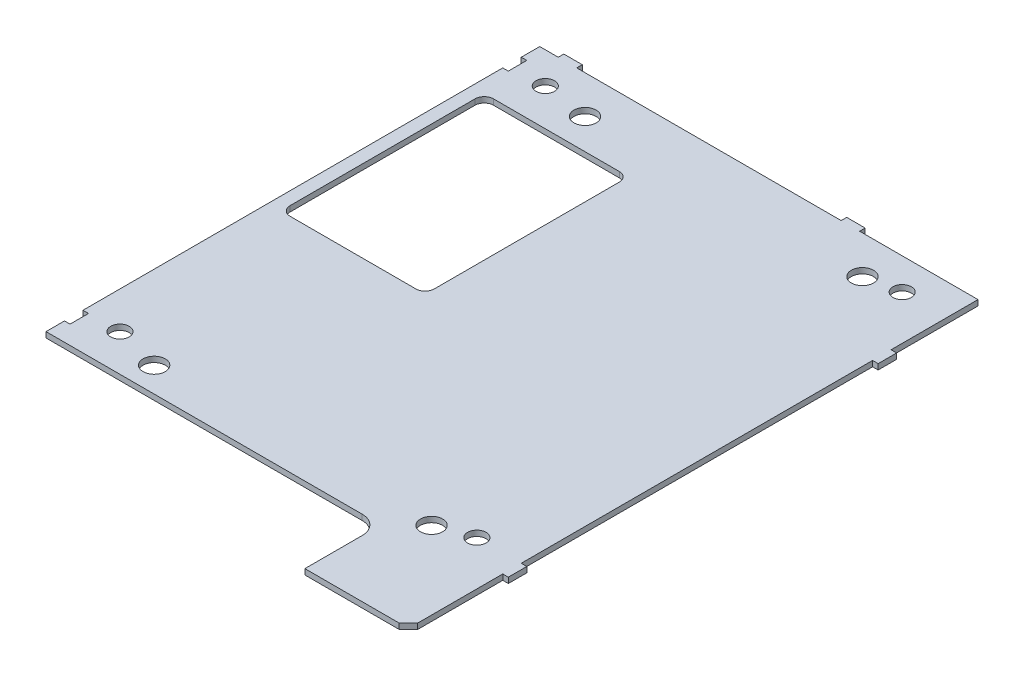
ISO-10303-21;
HEADER;
FILE_DESCRIPTION(('STEP AP214'),'2;1');
FILE_NAME('part.step','',(''),(''),'','','');
FILE_SCHEMA(('AUTOMOTIVE_DESIGN { 1 0 10303 214 1 1 1 1 }'));
ENDSEC;
DATA;
#1=APPLICATION_CONTEXT('core data for automotive mechanical design processes');
#2=APPLICATION_PROTOCOL_DEFINITION('international standard','automotive_design',2000,#1);
#3=PRODUCT_CONTEXT('',#1,'mechanical');
#4=PRODUCT('Part','Part','',(#3));
#5=PRODUCT_RELATED_PRODUCT_CATEGORY('part','',(#4));
#6=PRODUCT_DEFINITION_FORMATION('','',#4);
#7=PRODUCT_DEFINITION_CONTEXT('part definition',#1,'design');
#8=PRODUCT_DEFINITION('design','',#6,#7);
#9=PRODUCT_DEFINITION_SHAPE('','',#8);
#10=(LENGTH_UNIT() NAMED_UNIT(*) SI_UNIT(.MILLI.,.METRE.));
#11=(NAMED_UNIT(*) PLANE_ANGLE_UNIT() SI_UNIT($,.RADIAN.));
#12=(NAMED_UNIT(*) SI_UNIT($,.STERADIAN.) SOLID_ANGLE_UNIT());
#13=UNCERTAINTY_MEASURE_WITH_UNIT(LENGTH_MEASURE(1.E-05),#10,'distance_accuracy_value','');
#14=(GEOMETRIC_REPRESENTATION_CONTEXT(3) GLOBAL_UNCERTAINTY_ASSIGNED_CONTEXT((#13)) GLOBAL_UNIT_ASSIGNED_CONTEXT((#10,
#11,#12)) REPRESENTATION_CONTEXT('',''));
#15=CARTESIAN_POINT('',(0.,0.,0.));
#16=DIRECTION('',(0.,0.,1.));
#17=DIRECTION('',(1.,0.,0.));
#18=AXIS2_PLACEMENT_3D('',#15,#16,#17);
#19=CARTESIAN_POINT('',(254.,3.,8.00000000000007));
#20=DIRECTION('',(-1.,0.,0.));
#21=DIRECTION('',(0.,0.,1.));
#22=AXIS2_PLACEMENT_3D('',#19,#20,#21);
#23=PLANE('',#22);
#24=DIRECTION('',(0.,0.,-1.));
#25=VECTOR('',#24,1.);
#26=CARTESIAN_POINT('',(254.,3.,8.00000000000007));
#27=LINE('',#26,#25);
#28=CARTESIAN_POINT('',(254.,3.,-260.));
#29=VERTEX_POINT('',#28);
#30=CARTESIAN_POINT('',(254.,3.,-307.));
#31=VERTEX_POINT('',#30);
#32=EDGE_CURVE('E476',#29,#31,#27,.T.);
#33=ORIENTED_EDGE('',*,*,#32,.F.);
#34=DIRECTION('',(0.,-1.,0.));
#35=VECTOR('',#34,1.);
#36=CARTESIAN_POINT('',(254.,13.4403065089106,-260.));
#37=LINE('',#36,#35);
#38=CARTESIAN_POINT('',(254.,0.,-260.));
#39=VERTEX_POINT('',#38);
#40=EDGE_CURVE('E765',#29,#39,#37,.T.);
#41=ORIENTED_EDGE('',*,*,#40,.T.);
#42=DIRECTION('',(0.,0.,-1.));
#43=VECTOR('',#42,1.);
#44=CARTESIAN_POINT('',(254.,0.,8.00000000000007));
#45=LINE('',#44,#43);
#46=CARTESIAN_POINT('',(254.,0.,-307.));
#47=VERTEX_POINT('',#46);
#48=EDGE_CURVE('E474',#39,#47,#45,.T.);
#49=ORIENTED_EDGE('',*,*,#48,.T.);
#50=DIRECTION('',(0.,-1.,0.));
#51=VECTOR('',#50,1.);
#52=CARTESIAN_POINT('',(254.,3.,-307.));
#53=LINE('',#52,#51);
#54=EDGE_CURVE('E482',#31,#47,#53,.T.);
#55=ORIENTED_EDGE('',*,*,#54,.F.);
#56=EDGE_LOOP('',(#33,#41,#49,#55));
#57=FACE_BOUND('',#56,.T.);
#58=ADVANCED_FACE('F39',(#57),#23,.F.);
#59=CARTESIAN_POINT('',(254.,3.,-4.00000000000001));
#60=VERTEX_POINT('',#59);
#61=CARTESIAN_POINT('',(254.,3.,-50.));
#62=VERTEX_POINT('',#61);
#63=EDGE_CURVE('E480',#60,#62,#27,.T.);
#64=ORIENTED_EDGE('',*,*,#63,.F.);
#65=DIRECTION('',(0.,-1.,0.));
#66=VECTOR('',#65,1.);
#67=CARTESIAN_POINT('',(254.,0.,-4.00000000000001));
#68=LINE('',#67,#66);
#69=CARTESIAN_POINT('',(254.,0.,-4.00000000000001));
#70=VERTEX_POINT('',#69);
#71=EDGE_CURVE('E391',#60,#70,#68,.T.);
#72=ORIENTED_EDGE('',*,*,#71,.T.);
#73=CARTESIAN_POINT('',(254.,0.,-50.));
#74=VERTEX_POINT('',#73);
#75=EDGE_CURVE('E473',#70,#74,#45,.T.);
#76=ORIENTED_EDGE('',*,*,#75,.T.);
#77=DIRECTION('',(0.,-1.,0.));
#78=VECTOR('',#77,1.);
#79=CARTESIAN_POINT('',(254.,13.4403065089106,-50.));
#80=LINE('',#79,#78);
#81=EDGE_CURVE('E785',#62,#74,#80,.T.);
#82=ORIENTED_EDGE('',*,*,#81,.F.);
#83=EDGE_LOOP('',(#64,#72,#76,#82));
#84=FACE_BOUND('',#83,.T.);
#85=ADVANCED_FACE('F436',(#84),#23,.F.);
#86=CARTESIAN_POINT('',(0.,3.,-307.));
#87=DIRECTION('',(0.,0.,1.));
#88=DIRECTION('',(1.,0.,0.));
#89=AXIS2_PLACEMENT_3D('',#86,#87,#88);
#90=PLANE('',#89);
#91=DIRECTION('',(-1.,0.,0.));
#92=VECTOR('',#91,1.);
#93=CARTESIAN_POINT('',(0.,0.,-307.));
#94=LINE('',#93,#92);
#95=CARTESIAN_POINT('',(190.,0.,-307.));
#96=VERTEX_POINT('',#95);
#97=EDGE_CURVE('E326',#47,#96,#94,.T.);
#98=ORIENTED_EDGE('',*,*,#97,.T.);
#99=DIRECTION('',(0.,-1.,0.));
#100=VECTOR('',#99,1.);
#101=CARTESIAN_POINT('',(190.,13.4403065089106,-307.));
#102=LINE('',#101,#100);
#103=CARTESIAN_POINT('',(190.,3.,-307.));
#104=VERTEX_POINT('',#103);
#105=EDGE_CURVE('E815',#104,#96,#102,.T.);
#106=ORIENTED_EDGE('',*,*,#105,.F.);
#107=DIRECTION('',(-1.,0.,0.));
#108=VECTOR('',#107,1.);
#109=CARTESIAN_POINT('',(0.,3.,-307.));
#110=LINE('',#109,#108);
#111=EDGE_CURVE('E338',#31,#104,#110,.T.);
#112=ORIENTED_EDGE('',*,*,#111,.F.);
#113=ORIENTED_EDGE('',*,*,#54,.T.);
#114=EDGE_LOOP('',(#98,#106,#112,#113));
#115=FACE_BOUND('',#114,.T.);
#116=ADVANCED_FACE('F443',(#115),#90,.F.);
#117=CARTESIAN_POINT('',(180.,3.,-307.));
#118=VERTEX_POINT('',#117);
#119=CARTESIAN_POINT('',(37.0000000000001,3.,-307.));
#120=VERTEX_POINT('',#119);
#121=EDGE_CURVE('E337',#118,#120,#110,.T.);
#122=ORIENTED_EDGE('',*,*,#121,.F.);
#123=DIRECTION('',(0.,-1.,0.));
#124=VECTOR('',#123,1.);
#125=CARTESIAN_POINT('',(180.,13.4403065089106,-307.));
#126=LINE('',#125,#124);
#127=CARTESIAN_POINT('',(180.,0.,-307.));
#128=VERTEX_POINT('',#127);
#129=EDGE_CURVE('E812',#118,#128,#126,.T.);
#130=ORIENTED_EDGE('',*,*,#129,.T.);
#131=CARTESIAN_POINT('',(37.0000000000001,0.,-307.));
#132=VERTEX_POINT('',#131);
#133=EDGE_CURVE('E323',#128,#132,#94,.T.);
#134=ORIENTED_EDGE('',*,*,#133,.T.);
#135=DIRECTION('',(0.,-1.,0.));
#136=VECTOR('',#135,1.);
#137=CARTESIAN_POINT('',(37.0000000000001,13.4403065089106,-307.));
#138=LINE('',#137,#136);
#139=EDGE_CURVE('E831',#120,#132,#138,.T.);
#140=ORIENTED_EDGE('',*,*,#139,.F.);
#141=EDGE_LOOP('',(#122,#130,#134,#140));
#142=FACE_BOUND('',#141,.T.);
#143=ADVANCED_FACE('F839',(#142),#90,.F.);
#144=CARTESIAN_POINT('',(27.0000000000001,0.,-307.));
#145=VERTEX_POINT('',#144);
#146=CARTESIAN_POINT('',(17.0000000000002,0.,-307.));
#147=VERTEX_POINT('',#146);
#148=EDGE_CURVE('E312',#145,#147,#94,.T.);
#149=ORIENTED_EDGE('',*,*,#148,.T.);
#150=DIRECTION('',(0.,1.,0.));
#151=VECTOR('',#150,1.);
#152=CARTESIAN_POINT('',(17.0000000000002,0.,-307.));
#153=LINE('',#152,#151);
#154=CARTESIAN_POINT('',(17.0000000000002,3.,-307.));
#155=VERTEX_POINT('',#154);
#156=EDGE_CURVE('E294',#147,#155,#153,.T.);
#157=ORIENTED_EDGE('',*,*,#156,.T.);
#158=CARTESIAN_POINT('',(27.0000000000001,3.,-307.));
#159=VERTEX_POINT('',#158);
#160=EDGE_CURVE('E332',#159,#155,#110,.T.);
#161=ORIENTED_EDGE('',*,*,#160,.F.);
#162=DIRECTION('',(0.,-1.,0.));
#163=VECTOR('',#162,1.);
#164=CARTESIAN_POINT('',(27.0000000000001,13.4403065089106,-307.));
#165=LINE('',#164,#163);
#166=EDGE_CURVE('E322',#159,#145,#165,.T.);
#167=ORIENTED_EDGE('',*,*,#166,.T.);
#168=EDGE_LOOP('',(#149,#157,#161,#167));
#169=FACE_BOUND('',#168,.T.);
#170=ADVANCED_FACE('F320',(#169),#90,.F.);
#171=CARTESIAN_POINT('',(0.,3.,0.));
#172=DIRECTION('',(0.,1.,0.));
#173=DIRECTION('',(0.,0.,1.));
#174=AXIS2_PLACEMENT_3D('',#171,#172,#173);
#175=PLANE('',#174);
#176=DIRECTION('',(0.,0.,-1.));
#177=VECTOR('',#176,1.);
#178=CARTESIAN_POINT('',(17.0000000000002,3.,-307.));
#179=LINE('',#178,#177);
#180=CARTESIAN_POINT('',(17.0000000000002,3.,-40.));
#181=VERTEX_POINT('',#180);
#182=CARTESIAN_POINT('',(17.0000000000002,3.,-50.));
#183=VERTEX_POINT('',#182);
#184=EDGE_CURVE('E316',#181,#183,#179,.T.);
#185=ORIENTED_EDGE('',*,*,#184,.F.);
#186=DIRECTION('',(-1.,0.,0.));
#187=VECTOR('',#186,1.);
#188=CARTESIAN_POINT('',(254.,3.,-40.));
#189=LINE('',#188,#187);
#190=CARTESIAN_POINT('',(188.,3.,-40.));
#191=VERTEX_POINT('',#190);
#192=EDGE_CURVE('E705',#191,#181,#189,.T.);
#193=ORIENTED_EDGE('',*,*,#192,.F.);
#194=CARTESIAN_POINT('',(188.,3.,-30.));
#195=DIRECTION('',(0.,1.,0.));
#196=DIRECTION('',(0.,0.,1.));
#197=AXIS2_PLACEMENT_3D('',#194,#195,#196);
#198=CIRCLE('',#197,10.);
#199=CARTESIAN_POINT('',(198.,3.,-30.));
#200=VERTEX_POINT('',#199);
#201=EDGE_CURVE('E400',#191,#200,#198,.F.);
#202=ORIENTED_EDGE('',*,*,#201,.T.);
#203=DIRECTION('',(0.,0.,1.));
#204=VECTOR('',#203,1.);
#205=CARTESIAN_POINT('',(198.,3.,-40.));
#206=LINE('',#205,#204);
#207=CARTESIAN_POINT('',(198.,3.,1.00000000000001));
#208=VERTEX_POINT('',#207);
#209=EDGE_CURVE('E727',#200,#208,#206,.T.);
#210=ORIENTED_EDGE('',*,*,#209,.T.);
#211=DIRECTION('',(1.,0.,0.));
#212=VECTOR('',#211,1.);
#213=CARTESIAN_POINT('',(254.,3.,1.));
#214=LINE('',#213,#212);
#215=CARTESIAN_POINT('',(249.,3.,1.));
#216=VERTEX_POINT('',#215);
#217=EDGE_CURVE('E733',#208,#216,#214,.T.);
#218=ORIENTED_EDGE('',*,*,#217,.T.);
#219=DIRECTION('',(0.707106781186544,0.,-0.707106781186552));
#220=VECTOR('',#219,1.);
#221=CARTESIAN_POINT('',(125.000000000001,3.,125.));
#222=LINE('',#221,#220);
#223=EDGE_CURVE('E389',#216,#60,#222,.T.);
#224=ORIENTED_EDGE('',*,*,#223,.T.);
#225=ORIENTED_EDGE('',*,*,#63,.T.);
#226=DIRECTION('',(-1.,0.,0.));
#227=VECTOR('',#226,1.);
#228=CARTESIAN_POINT('',(254.,3.,-50.));
#229=LINE('',#228,#227);
#230=CARTESIAN_POINT('',(257.,3.,-50.));
#231=VERTEX_POINT('',#230);
#232=EDGE_CURVE('E782',#231,#62,#229,.T.);
#233=ORIENTED_EDGE('',*,*,#232,.F.);
#234=DIRECTION('',(0.,0.,1.));
#235=VECTOR('',#234,1.);
#236=CARTESIAN_POINT('',(257.,3.,-50.));
#237=LINE('',#236,#235);
#238=CARTESIAN_POINT('',(257.,3.,-60.));
#239=VERTEX_POINT('',#238);
#240=EDGE_CURVE('E787',#239,#231,#237,.T.);
#241=ORIENTED_EDGE('',*,*,#240,.F.);
#242=DIRECTION('',(1.,0.,0.));
#243=VECTOR('',#242,1.);
#244=CARTESIAN_POINT('',(254.,3.,-60.));
#245=LINE('',#244,#243);
#246=CARTESIAN_POINT('',(254.,3.,-60.));
#247=VERTEX_POINT('',#246);
#248=EDGE_CURVE('E774',#247,#239,#245,.T.);
#249=ORIENTED_EDGE('',*,*,#248,.F.);
#250=CARTESIAN_POINT('',(254.,3.,-250.));
#251=VERTEX_POINT('',#250);
#252=EDGE_CURVE('E852',#247,#251,#27,.T.);
#253=ORIENTED_EDGE('',*,*,#252,.T.);
#254=DIRECTION('',(-1.,0.,0.));
#255=VECTOR('',#254,1.);
#256=CARTESIAN_POINT('',(254.,3.,-250.));
#257=LINE('',#256,#255);
#258=CARTESIAN_POINT('',(257.,3.,-250.));
#259=VERTEX_POINT('',#258);
#260=EDGE_CURVE('E758',#259,#251,#257,.T.);
#261=ORIENTED_EDGE('',*,*,#260,.F.);
#262=DIRECTION('',(0.,0.,1.));
#263=VECTOR('',#262,1.);
#264=CARTESIAN_POINT('',(257.,3.,-250.));
#265=LINE('',#264,#263);
#266=CARTESIAN_POINT('',(257.,3.,-260.));
#267=VERTEX_POINT('',#266);
#268=EDGE_CURVE('E761',#267,#259,#265,.T.);
#269=ORIENTED_EDGE('',*,*,#268,.F.);
#270=DIRECTION('',(1.,0.,0.));
#271=VECTOR('',#270,1.);
#272=CARTESIAN_POINT('',(254.,3.,-260.));
#273=LINE('',#272,#271);
#274=EDGE_CURVE('E748',#29,#267,#273,.T.);
#275=ORIENTED_EDGE('',*,*,#274,.F.);
#276=ORIENTED_EDGE('',*,*,#32,.T.);
#277=ORIENTED_EDGE('',*,*,#111,.T.);
#278=DIRECTION('',(0.,0.,1.));
#279=VECTOR('',#278,1.);
#280=CARTESIAN_POINT('',(190.,3.,-307.));
#281=LINE('',#280,#279);
#282=CARTESIAN_POINT('',(190.,3.,-310.));
#283=VERTEX_POINT('',#282);
#284=EDGE_CURVE('E813',#283,#104,#281,.T.);
#285=ORIENTED_EDGE('',*,*,#284,.F.);
#286=DIRECTION('',(1.,0.,0.));
#287=VECTOR('',#286,1.);
#288=CARTESIAN_POINT('',(180.,3.,-310.));
#289=LINE('',#288,#287);
#290=CARTESIAN_POINT('',(180.,3.,-310.));
#291=VERTEX_POINT('',#290);
#292=EDGE_CURVE('E799',#291,#283,#289,.T.);
#293=ORIENTED_EDGE('',*,*,#292,.F.);
#294=DIRECTION('',(0.,0.,-1.));
#295=VECTOR('',#294,1.);
#296=CARTESIAN_POINT('',(180.,3.,-307.));
#297=LINE('',#296,#295);
#298=EDGE_CURVE('E808',#118,#291,#297,.T.);
#299=ORIENTED_EDGE('',*,*,#298,.F.);
#300=ORIENTED_EDGE('',*,*,#121,.T.);
#301=DIRECTION('',(0.,0.,1.));
#302=VECTOR('',#301,1.);
#303=CARTESIAN_POINT('',(37.0000000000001,3.,-307.));
#304=LINE('',#303,#302);
#305=CARTESIAN_POINT('',(37.0000000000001,3.,-310.));
#306=VERTEX_POINT('',#305);
#307=EDGE_CURVE('E828',#306,#120,#304,.T.);
#308=ORIENTED_EDGE('',*,*,#307,.F.);
#309=DIRECTION('',(1.,0.,0.));
#310=VECTOR('',#309,1.);
#311=CARTESIAN_POINT('',(27.0000000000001,3.,-310.));
#312=LINE('',#311,#310);
#313=CARTESIAN_POINT('',(27.0000000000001,3.,-310.));
#314=VERTEX_POINT('',#313);
#315=EDGE_CURVE('E701',#314,#306,#312,.T.);
#316=ORIENTED_EDGE('',*,*,#315,.F.);
#317=DIRECTION('',(0.,0.,-1.));
#318=VECTOR('',#317,1.);
#319=CARTESIAN_POINT('',(27.0000000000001,3.,-307.));
#320=LINE('',#319,#318);
#321=EDGE_CURVE('E706',#159,#314,#320,.T.);
#322=ORIENTED_EDGE('',*,*,#321,.F.);
#323=ORIENTED_EDGE('',*,*,#160,.T.);
#324=CARTESIAN_POINT('',(17.0000000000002,3.,-297.));
#325=VERTEX_POINT('',#324);
#326=EDGE_CURVE('E297',#325,#155,#179,.T.);
#327=ORIENTED_EDGE('',*,*,#326,.F.);
#328=DIRECTION('',(1.,0.,0.));
#329=VECTOR('',#328,1.);
#330=CARTESIAN_POINT('',(-19.9999999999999,3.,-297.));
#331=LINE('',#330,#329);
#332=CARTESIAN_POINT('',(20.0000000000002,3.,-297.));
#333=VERTEX_POINT('',#332);
#334=EDGE_CURVE('E484',#325,#333,#331,.T.);
#335=ORIENTED_EDGE('',*,*,#334,.T.);
#336=DIRECTION('',(0.,0.,1.));
#337=VECTOR('',#336,1.);
#338=CARTESIAN_POINT('',(20.0000000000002,3.,-287.));
#339=LINE('',#338,#337);
#340=CARTESIAN_POINT('',(20.0000000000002,3.,-287.));
#341=VERTEX_POINT('',#340);
#342=EDGE_CURVE('E486',#333,#341,#339,.T.);
#343=ORIENTED_EDGE('',*,*,#342,.T.);
#344=DIRECTION('',(-1.,0.,0.));
#345=VECTOR('',#344,1.);
#346=CARTESIAN_POINT('',(-19.9999999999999,3.,-287.));
#347=LINE('',#346,#345);
#348=CARTESIAN_POINT('',(17.0000000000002,3.,-287.));
#349=VERTEX_POINT('',#348);
#350=EDGE_CURVE('E490',#341,#349,#347,.T.);
#351=ORIENTED_EDGE('',*,*,#350,.T.);
#352=CARTESIAN_POINT('',(17.0000000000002,3.,-60.));
#353=VERTEX_POINT('',#352);
#354=EDGE_CURVE('E54',#353,#349,#179,.T.);
#355=ORIENTED_EDGE('',*,*,#354,.F.);
#356=DIRECTION('',(1.,0.,0.));
#357=VECTOR('',#356,1.);
#358=CARTESIAN_POINT('',(-19.9999999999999,3.,-60.));
#359=LINE('',#358,#357);
#360=CARTESIAN_POINT('',(20.0000000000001,3.,-60.));
#361=VERTEX_POINT('',#360);
#362=EDGE_CURVE('E505',#353,#361,#359,.T.);
#363=ORIENTED_EDGE('',*,*,#362,.T.);
#364=DIRECTION('',(0.,0.,1.));
#365=VECTOR('',#364,1.);
#366=CARTESIAN_POINT('',(20.0000000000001,3.,-50.));
#367=LINE('',#366,#365);
#368=CARTESIAN_POINT('',(20.0000000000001,3.,-50.));
#369=VERTEX_POINT('',#368);
#370=EDGE_CURVE('E507',#361,#369,#367,.T.);
#371=ORIENTED_EDGE('',*,*,#370,.T.);
#372=DIRECTION('',(-1.,0.,0.));
#373=VECTOR('',#372,1.);
#374=CARTESIAN_POINT('',(-19.9999999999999,3.,-50.));
#375=LINE('',#374,#373);
#376=EDGE_CURVE('E511',#369,#183,#375,.T.);
#377=ORIENTED_EDGE('',*,*,#376,.T.);
#378=EDGE_LOOP('',(#185,#193,#202,#210,#218,#224,#225,#233,#241,#249,#253,#261,#269,#275,#276,
#277,#285,#293,#299,#300,#308,#316,#322,#323,#327,#335,#343,#351,#355,#363,#371,#377));
#379=FACE_BOUND('',#378,.T.);
#380=CARTESIAN_POINT('',(230.,3.,-60.));
#381=DIRECTION('',(0.,-1.,0.));
#382=DIRECTION('',(0.,0.,-1.));
#383=AXIS2_PLACEMENT_3D('',#380,#381,#382);
#384=CIRCLE('',#383,5.00000000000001);
#385=CARTESIAN_POINT('',(230.,3.,-65.));
#386=VERTEX_POINT('',#385);
#387=EDGE_CURVE('E868',#386,#386,#384,.T.);
#388=ORIENTED_EDGE('',*,*,#387,.T.);
#389=EDGE_LOOP('',(#388));
#390=FACE_BOUND('',#389,.T.);
#391=CARTESIAN_POINT('',(37.0000000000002,3.,-60.));
#392=DIRECTION('',(0.,-1.,0.));
#393=DIRECTION('',(0.,0.,-1.));
#394=AXIS2_PLACEMENT_3D('',#391,#392,#393);
#395=CIRCLE('',#394,5.00000000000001);
#396=CARTESIAN_POINT('',(37.0000000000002,3.,-65.));
#397=VERTEX_POINT('',#396);
#398=EDGE_CURVE('E734',#397,#397,#395,.T.);
#399=ORIENTED_EDGE('',*,*,#398,.T.);
#400=EDGE_LOOP('',(#399));
#401=FACE_BOUND('',#400,.T.);
#402=CARTESIAN_POINT('',(62.0000000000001,3.,-53.5));
#403=DIRECTION('',(0.,-1.,0.));
#404=DIRECTION('',(0.,0.,-1.));
#405=AXIS2_PLACEMENT_3D('',#402,#403,#404);
#406=CIRCLE('',#405,5.99999999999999);
#407=CARTESIAN_POINT('',(62.0000000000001,3.,-59.5));
#408=VERTEX_POINT('',#407);
#409=EDGE_CURVE('E528',#408,#408,#406,.T.);
#410=ORIENTED_EDGE('',*,*,#409,.T.);
#411=EDGE_LOOP('',(#410));
#412=FACE_BOUND('',#411,.T.);
#413=CARTESIAN_POINT('',(212.,3.,-53.5));
#414=DIRECTION('',(0.,-1.,0.));
#415=DIRECTION('',(0.,0.,-1.));
#416=AXIS2_PLACEMENT_3D('',#413,#414,#415);
#417=CIRCLE('',#416,6.00000000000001);
#418=CARTESIAN_POINT('',(212.,3.,-59.5));
#419=VERTEX_POINT('',#418);
#420=EDGE_CURVE('E534',#419,#419,#417,.T.);
#421=ORIENTED_EDGE('',*,*,#420,.T.);
#422=EDGE_LOOP('',(#421));
#423=FACE_BOUND('',#422,.T.);
#424=CARTESIAN_POINT('',(212.,3.,-286.5));
#425=DIRECTION('',(0.,-1.,0.));
#426=DIRECTION('',(0.,0.,-1.));
#427=AXIS2_PLACEMENT_3D('',#424,#425,#426);
#428=CIRCLE('',#427,6.00000000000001);
#429=CARTESIAN_POINT('',(212.,3.,-292.5));
#430=VERTEX_POINT('',#429);
#431=EDGE_CURVE('E540',#430,#430,#428,.T.);
#432=ORIENTED_EDGE('',*,*,#431,.T.);
#433=EDGE_LOOP('',(#432));
#434=FACE_BOUND('',#433,.T.);
#435=CARTESIAN_POINT('',(62.0000000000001,3.,-286.5));
#436=DIRECTION('',(0.,-1.,0.));
#437=DIRECTION('',(0.,0.,-1.));
#438=AXIS2_PLACEMENT_3D('',#435,#436,#437);
#439=CIRCLE('',#438,5.99999999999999);
#440=CARTESIAN_POINT('',(62.0000000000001,3.,-292.5));
#441=VERTEX_POINT('',#440);
#442=EDGE_CURVE('E546',#441,#441,#439,.T.);
#443=ORIENTED_EDGE('',*,*,#442,.T.);
#444=EDGE_LOOP('',(#443));
#445=FACE_BOUND('',#444,.T.);
#446=DIRECTION('',(0.,0.,-1.));
#447=VECTOR('',#446,1.);
#448=CARTESIAN_POINT('',(102.,3.,-270.));
#449=LINE('',#448,#447);
#450=CARTESIAN_POINT('',(102.,3.,-165.));
#451=VERTEX_POINT('',#450);
#452=CARTESIAN_POINT('',(102.,3.,-265.));
#453=VERTEX_POINT('',#452);
#454=EDGE_CURVE('E561',#451,#453,#449,.T.);
#455=ORIENTED_EDGE('',*,*,#454,.F.);
#456=CARTESIAN_POINT('',(97.,3.,-165.));
#457=DIRECTION('',(0.,1.,0.));
#458=DIRECTION('',(0.,0.,1.));
#459=AXIS2_PLACEMENT_3D('',#456,#457,#458);
#460=CIRCLE('',#459,5.);
#461=CARTESIAN_POINT('',(97.,3.,-160.));
#462=VERTEX_POINT('',#461);
#463=EDGE_CURVE('E382',#451,#462,#460,.F.);
#464=ORIENTED_EDGE('',*,*,#463,.T.);
#465=DIRECTION('',(-1.,0.,0.));
#466=VECTOR('',#465,1.);
#467=CARTESIAN_POINT('',(24.0000000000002,3.,-160.));
#468=LINE('',#467,#466);
#469=CARTESIAN_POINT('',(29.0000000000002,3.,-160.));
#470=VERTEX_POINT('',#469);
#471=EDGE_CURVE('E549',#462,#470,#468,.T.);
#472=ORIENTED_EDGE('',*,*,#471,.T.);
#473=CARTESIAN_POINT('',(29.0000000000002,3.,-165.));
#474=DIRECTION('',(0.,1.,0.));
#475=DIRECTION('',(0.,0.,1.));
#476=AXIS2_PLACEMENT_3D('',#473,#474,#475);
#477=CIRCLE('',#476,5.);
#478=CARTESIAN_POINT('',(24.0000000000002,3.,-165.));
#479=VERTEX_POINT('',#478);
#480=EDGE_CURVE('E378',#470,#479,#477,.F.);
#481=ORIENTED_EDGE('',*,*,#480,.T.);
#482=DIRECTION('',(0.,0.,1.));
#483=VECTOR('',#482,1.);
#484=CARTESIAN_POINT('',(24.0000000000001,3.,-70.));
#485=LINE('',#484,#483);
#486=CARTESIAN_POINT('',(24.0000000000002,3.,-265.));
#487=VERTEX_POINT('',#486);
#488=EDGE_CURVE('E558',#487,#479,#485,.T.);
#489=ORIENTED_EDGE('',*,*,#488,.F.);
#490=CARTESIAN_POINT('',(29.0000000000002,3.,-265.));
#491=DIRECTION('',(0.,1.,0.));
#492=DIRECTION('',(0.,0.,1.));
#493=AXIS2_PLACEMENT_3D('',#490,#491,#492);
#494=CIRCLE('',#493,5.);
#495=CARTESIAN_POINT('',(29.0000000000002,3.,-270.));
#496=VERTEX_POINT('',#495);
#497=EDGE_CURVE('E366',#487,#496,#494,.F.);
#498=ORIENTED_EDGE('',*,*,#497,.T.);
#499=DIRECTION('',(-1.,0.,0.));
#500=VECTOR('',#499,1.);
#501=CARTESIAN_POINT('',(0.,3.,-270.));
#502=LINE('',#501,#500);
#503=CARTESIAN_POINT('',(97.,3.,-270.));
#504=VERTEX_POINT('',#503);
#505=EDGE_CURVE('E562',#504,#496,#502,.T.);
#506=ORIENTED_EDGE('',*,*,#505,.F.);
#507=CARTESIAN_POINT('',(97.,3.,-265.));
#508=DIRECTION('',(0.,1.,0.));
#509=DIRECTION('',(0.,0.,1.));
#510=AXIS2_PLACEMENT_3D('',#507,#508,#509);
#511=CIRCLE('',#510,5.);
#512=EDGE_CURVE('E352',#504,#453,#511,.F.);
#513=ORIENTED_EDGE('',*,*,#512,.T.);
#514=EDGE_LOOP('',(#455,#464,#472,#481,#489,#498,#506,#513));
#515=FACE_BOUND('',#514,.T.);
#516=CARTESIAN_POINT('',(37.0000000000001,3.,-290.));
#517=DIRECTION('',(0.,-1.,0.));
#518=DIRECTION('',(0.,0.,-1.));
#519=AXIS2_PLACEMENT_3D('',#516,#517,#518);
#520=CIRCLE('',#519,5.00000000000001);
#521=CARTESIAN_POINT('',(37.0000000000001,3.,-295.));
#522=VERTEX_POINT('',#521);
#523=EDGE_CURVE('E404',#522,#522,#520,.T.);
#524=ORIENTED_EDGE('',*,*,#523,.T.);
#525=EDGE_LOOP('',(#524));
#526=FACE_BOUND('',#525,.T.);
#527=CARTESIAN_POINT('',(230.,3.,-290.));
#528=DIRECTION('',(0.,-1.,0.));
#529=DIRECTION('',(0.,0.,-1.));
#530=AXIS2_PLACEMENT_3D('',#527,#528,#529);
#531=CIRCLE('',#530,5.00000000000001);
#532=CARTESIAN_POINT('',(230.,3.,-295.));
#533=VERTEX_POINT('',#532);
#534=EDGE_CURVE('E47',#533,#533,#531,.T.);
#535=ORIENTED_EDGE('',*,*,#534,.T.);
#536=EDGE_LOOP('',(#535));
#537=FACE_BOUND('',#536,.T.);
#538=ADVANCED_FACE('F412',(#379,#390,#401,#412,#423,#434,#445,#515,#526,#537),#175,.T.);
#539=CARTESIAN_POINT('',(0.,0.,0.));
#540=DIRECTION('',(0.,1.,0.));
#541=DIRECTION('',(0.,0.,1.));
#542=AXIS2_PLACEMENT_3D('',#539,#540,#541);
#543=PLANE('',#542);
#544=CARTESIAN_POINT('',(230.,0.,-60.));
#545=DIRECTION('',(0.,-1.,0.));
#546=DIRECTION('',(0.,0.,-1.));
#547=AXIS2_PLACEMENT_3D('',#544,#545,#546);
#548=CIRCLE('',#547,5.00000000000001);
#549=CARTESIAN_POINT('',(230.,0.,-65.));
#550=VERTEX_POINT('',#549);
#551=EDGE_CURVE('E864',#550,#550,#548,.T.);
#552=ORIENTED_EDGE('',*,*,#551,.F.);
#553=EDGE_LOOP('',(#552));
#554=FACE_BOUND('',#553,.T.);
#555=CARTESIAN_POINT('',(37.0000000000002,0.,-60.));
#556=DIRECTION('',(0.,-1.,0.));
#557=DIRECTION('',(0.,0.,-1.));
#558=AXIS2_PLACEMENT_3D('',#555,#556,#557);
#559=CIRCLE('',#558,5.00000000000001);
#560=CARTESIAN_POINT('',(37.0000000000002,0.,-65.));
#561=VERTEX_POINT('',#560);
#562=EDGE_CURVE('E738',#561,#561,#559,.T.);
#563=ORIENTED_EDGE('',*,*,#562,.F.);
#564=EDGE_LOOP('',(#563));
#565=FACE_BOUND('',#564,.T.);
#566=CARTESIAN_POINT('',(62.0000000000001,0.,-53.5));
#567=DIRECTION('',(0.,-1.,0.));
#568=DIRECTION('',(0.,0.,-1.));
#569=AXIS2_PLACEMENT_3D('',#566,#567,#568);
#570=CIRCLE('',#569,5.99999999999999);
#571=CARTESIAN_POINT('',(62.0000000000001,0.,-59.5));
#572=VERTEX_POINT('',#571);
#573=EDGE_CURVE('E523',#572,#572,#570,.T.);
#574=ORIENTED_EDGE('',*,*,#573,.F.);
#575=EDGE_LOOP('',(#574));
#576=FACE_BOUND('',#575,.T.);
#577=CARTESIAN_POINT('',(212.,0.,-53.5));
#578=DIRECTION('',(0.,-1.,0.));
#579=DIRECTION('',(0.,0.,-1.));
#580=AXIS2_PLACEMENT_3D('',#577,#578,#579);
#581=CIRCLE('',#580,5.99999999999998);
#582=CARTESIAN_POINT('',(212.,0.,-59.5));
#583=VERTEX_POINT('',#582);
#584=EDGE_CURVE('E531',#583,#583,#581,.T.);
#585=ORIENTED_EDGE('',*,*,#584,.F.);
#586=EDGE_LOOP('',(#585));
#587=FACE_BOUND('',#586,.T.);
#588=CARTESIAN_POINT('',(212.,0.,-286.5));
#589=DIRECTION('',(0.,-1.,0.));
#590=DIRECTION('',(0.,0.,-1.));
#591=AXIS2_PLACEMENT_3D('',#588,#589,#590);
#592=CIRCLE('',#591,5.99999999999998);
#593=CARTESIAN_POINT('',(212.,0.,-292.5));
#594=VERTEX_POINT('',#593);
#595=EDGE_CURVE('E537',#594,#594,#592,.T.);
#596=ORIENTED_EDGE('',*,*,#595,.F.);
#597=EDGE_LOOP('',(#596));
#598=FACE_BOUND('',#597,.T.);
#599=CARTESIAN_POINT('',(62.0000000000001,0.,-286.5));
#600=DIRECTION('',(0.,-1.,0.));
#601=DIRECTION('',(0.,0.,-1.));
#602=AXIS2_PLACEMENT_3D('',#599,#600,#601);
#603=CIRCLE('',#602,5.99999999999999);
#604=CARTESIAN_POINT('',(62.0000000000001,0.,-292.5));
#605=VERTEX_POINT('',#604);
#606=EDGE_CURVE('E543',#605,#605,#603,.T.);
#607=ORIENTED_EDGE('',*,*,#606,.F.);
#608=EDGE_LOOP('',(#607));
#609=FACE_BOUND('',#608,.T.);
#610=DIRECTION('',(0.,0.,1.));
#611=VECTOR('',#610,1.);
#612=CARTESIAN_POINT('',(24.0000000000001,0.,-70.));
#613=LINE('',#612,#611);
#614=CARTESIAN_POINT('',(24.0000000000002,0.,-265.));
#615=VERTEX_POINT('',#614);
#616=CARTESIAN_POINT('',(24.0000000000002,0.,-165.));
#617=VERTEX_POINT('',#616);
#618=EDGE_CURVE('E553',#615,#617,#613,.T.);
#619=ORIENTED_EDGE('',*,*,#618,.T.);
#620=CARTESIAN_POINT('',(29.0000000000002,0.,-165.));
#621=DIRECTION('',(0.,1.,0.));
#622=DIRECTION('',(0.,0.,1.));
#623=AXIS2_PLACEMENT_3D('',#620,#621,#622);
#624=CIRCLE('',#623,5.);
#625=CARTESIAN_POINT('',(29.0000000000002,0.,-160.));
#626=VERTEX_POINT('',#625);
#627=EDGE_CURVE('E380',#617,#626,#624,.T.);
#628=ORIENTED_EDGE('',*,*,#627,.T.);
#629=DIRECTION('',(1.,0.,0.));
#630=VECTOR('',#629,1.);
#631=CARTESIAN_POINT('',(24.0000000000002,0.,-160.));
#632=LINE('',#631,#630);
#633=CARTESIAN_POINT('',(97.,0.,-160.));
#634=VERTEX_POINT('',#633);
#635=EDGE_CURVE('E550',#626,#634,#632,.T.);
#636=ORIENTED_EDGE('',*,*,#635,.T.);
#637=CARTESIAN_POINT('',(97.,0.,-165.));
#638=DIRECTION('',(0.,1.,0.));
#639=DIRECTION('',(0.,0.,1.));
#640=AXIS2_PLACEMENT_3D('',#637,#638,#639);
#641=CIRCLE('',#640,5.);
#642=CARTESIAN_POINT('',(102.,0.,-165.));
#643=VERTEX_POINT('',#642);
#644=EDGE_CURVE('E384',#634,#643,#641,.T.);
#645=ORIENTED_EDGE('',*,*,#644,.T.);
#646=DIRECTION('',(0.,0.,-1.));
#647=VECTOR('',#646,1.);
#648=CARTESIAN_POINT('',(102.,0.,-270.));
#649=LINE('',#648,#647);
#650=CARTESIAN_POINT('',(102.,0.,-265.));
#651=VERTEX_POINT('',#650);
#652=EDGE_CURVE('E328',#643,#651,#649,.T.);
#653=ORIENTED_EDGE('',*,*,#652,.T.);
#654=CARTESIAN_POINT('',(97.,0.,-265.));
#655=DIRECTION('',(0.,1.,0.));
#656=DIRECTION('',(0.,0.,1.));
#657=AXIS2_PLACEMENT_3D('',#654,#655,#656);
#658=CIRCLE('',#657,5.);
#659=CARTESIAN_POINT('',(97.,0.,-270.));
#660=VERTEX_POINT('',#659);
#661=EDGE_CURVE('E357',#651,#660,#658,.T.);
#662=ORIENTED_EDGE('',*,*,#661,.T.);
#663=DIRECTION('',(-1.,0.,0.));
#664=VECTOR('',#663,1.);
#665=CARTESIAN_POINT('',(0.,0.,-270.));
#666=LINE('',#665,#664);
#667=CARTESIAN_POINT('',(29.0000000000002,0.,-270.));
#668=VERTEX_POINT('',#667);
#669=EDGE_CURVE('E324',#660,#668,#666,.T.);
#670=ORIENTED_EDGE('',*,*,#669,.T.);
#671=CARTESIAN_POINT('',(29.0000000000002,0.,-265.));
#672=DIRECTION('',(0.,1.,0.));
#673=DIRECTION('',(0.,0.,1.));
#674=AXIS2_PLACEMENT_3D('',#671,#672,#673);
#675=CIRCLE('',#674,5.);
#676=EDGE_CURVE('E364',#668,#615,#675,.T.);
#677=ORIENTED_EDGE('',*,*,#676,.T.);
#678=EDGE_LOOP('',(#619,#628,#636,#645,#653,#662,#670,#677));
#679=FACE_BOUND('',#678,.T.);
#680=DIRECTION('',(-1.,0.,0.));
#681=VECTOR('',#680,1.);
#682=CARTESIAN_POINT('',(254.,0.,-40.));
#683=LINE('',#682,#681);
#684=CARTESIAN_POINT('',(188.,0.,-40.));
#685=VERTEX_POINT('',#684);
#686=CARTESIAN_POINT('',(17.0000000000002,0.,-40.));
#687=VERTEX_POINT('',#686);
#688=EDGE_CURVE('E477',#685,#687,#683,.T.);
#689=ORIENTED_EDGE('',*,*,#688,.T.);
#690=DIRECTION('',(0.,0.,-1.));
#691=VECTOR('',#690,1.);
#692=CARTESIAN_POINT('',(17.0000000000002,0.,-307.));
#693=LINE('',#692,#691);
#694=CARTESIAN_POINT('',(17.0000000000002,0.,-50.));
#695=VERTEX_POINT('',#694);
#696=EDGE_CURVE('E318',#687,#695,#693,.T.);
#697=ORIENTED_EDGE('',*,*,#696,.T.);
#698=DIRECTION('',(-1.,0.,0.));
#699=VECTOR('',#698,1.);
#700=CARTESIAN_POINT('',(-19.9999999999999,0.,-50.));
#701=LINE('',#700,#699);
#702=CARTESIAN_POINT('',(20.0000000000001,0.,-50.));
#703=VERTEX_POINT('',#702);
#704=EDGE_CURVE('E508',#703,#695,#701,.T.);
#705=ORIENTED_EDGE('',*,*,#704,.F.);
#706=DIRECTION('',(0.,0.,1.));
#707=VECTOR('',#706,1.);
#708=CARTESIAN_POINT('',(20.0000000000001,0.,-50.));
#709=LINE('',#708,#707);
#710=CARTESIAN_POINT('',(20.0000000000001,0.,-60.));
#711=VERTEX_POINT('',#710);
#712=EDGE_CURVE('E516',#711,#703,#709,.T.);
#713=ORIENTED_EDGE('',*,*,#712,.F.);
#714=DIRECTION('',(1.,0.,0.));
#715=VECTOR('',#714,1.);
#716=CARTESIAN_POINT('',(-19.9999999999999,0.,-60.));
#717=LINE('',#716,#715);
#718=CARTESIAN_POINT('',(17.0000000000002,0.,-60.));
#719=VERTEX_POINT('',#718);
#720=EDGE_CURVE('E502',#719,#711,#717,.T.);
#721=ORIENTED_EDGE('',*,*,#720,.F.);
#722=CARTESIAN_POINT('',(17.0000000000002,0.,-287.));
#723=VERTEX_POINT('',#722);
#724=EDGE_CURVE('E315',#719,#723,#693,.T.);
#725=ORIENTED_EDGE('',*,*,#724,.T.);
#726=DIRECTION('',(-1.,0.,0.));
#727=VECTOR('',#726,1.);
#728=CARTESIAN_POINT('',(-19.9999999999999,0.,-287.));
#729=LINE('',#728,#727);
#730=CARTESIAN_POINT('',(20.0000000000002,0.,-287.));
#731=VERTEX_POINT('',#730);
#732=EDGE_CURVE('E487',#731,#723,#729,.T.);
#733=ORIENTED_EDGE('',*,*,#732,.F.);
#734=DIRECTION('',(0.,0.,1.));
#735=VECTOR('',#734,1.);
#736=CARTESIAN_POINT('',(20.0000000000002,0.,-287.));
#737=LINE('',#736,#735);
#738=CARTESIAN_POINT('',(20.0000000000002,0.,-297.));
#739=VERTEX_POINT('',#738);
#740=EDGE_CURVE('E495',#739,#731,#737,.T.);
#741=ORIENTED_EDGE('',*,*,#740,.F.);
#742=DIRECTION('',(1.,0.,0.));
#743=VECTOR('',#742,1.);
#744=CARTESIAN_POINT('',(-19.9999999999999,0.,-297.));
#745=LINE('',#744,#743);
#746=CARTESIAN_POINT('',(17.0000000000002,0.,-297.));
#747=VERTEX_POINT('',#746);
#748=EDGE_CURVE('E314',#747,#739,#745,.T.);
#749=ORIENTED_EDGE('',*,*,#748,.F.);
#750=EDGE_CURVE('E62',#747,#147,#693,.T.);
#751=ORIENTED_EDGE('',*,*,#750,.T.);
#752=ORIENTED_EDGE('',*,*,#148,.F.);
#753=DIRECTION('',(0.,0.,-1.));
#754=VECTOR('',#753,1.);
#755=CARTESIAN_POINT('',(27.0000000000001,0.,-307.));
#756=LINE('',#755,#754);
#757=CARTESIAN_POINT('',(27.0000000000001,0.,-310.));
#758=VERTEX_POINT('',#757);
#759=EDGE_CURVE('E821',#145,#758,#756,.T.);
#760=ORIENTED_EDGE('',*,*,#759,.T.);
#761=DIRECTION('',(1.,0.,0.));
#762=VECTOR('',#761,1.);
#763=CARTESIAN_POINT('',(27.0000000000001,0.,-310.));
#764=LINE('',#763,#762);
#765=CARTESIAN_POINT('',(37.0000000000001,0.,-310.));
#766=VERTEX_POINT('',#765);
#767=EDGE_CURVE('E703',#758,#766,#764,.T.);
#768=ORIENTED_EDGE('',*,*,#767,.T.);
#769=DIRECTION('',(0.,0.,1.));
#770=VECTOR('',#769,1.);
#771=CARTESIAN_POINT('',(37.0000000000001,0.,-307.));
#772=LINE('',#771,#770);
#773=EDGE_CURVE('E822',#766,#132,#772,.T.);
#774=ORIENTED_EDGE('',*,*,#773,.T.);
#775=ORIENTED_EDGE('',*,*,#133,.F.);
#776=DIRECTION('',(0.,0.,-1.));
#777=VECTOR('',#776,1.);
#778=CARTESIAN_POINT('',(180.,0.,-307.));
#779=LINE('',#778,#777);
#780=CARTESIAN_POINT('',(180.,0.,-310.));
#781=VERTEX_POINT('',#780);
#782=EDGE_CURVE('E795',#128,#781,#779,.T.);
#783=ORIENTED_EDGE('',*,*,#782,.T.);
#784=DIRECTION('',(1.,0.,0.));
#785=VECTOR('',#784,1.);
#786=CARTESIAN_POINT('',(180.,0.,-310.));
#787=LINE('',#786,#785);
#788=CARTESIAN_POINT('',(190.,0.,-310.));
#789=VERTEX_POINT('',#788);
#790=EDGE_CURVE('E800',#781,#789,#787,.T.);
#791=ORIENTED_EDGE('',*,*,#790,.T.);
#792=DIRECTION('',(0.,0.,1.));
#793=VECTOR('',#792,1.);
#794=CARTESIAN_POINT('',(190.,0.,-307.));
#795=LINE('',#794,#793);
#796=EDGE_CURVE('E796',#789,#96,#795,.T.);
#797=ORIENTED_EDGE('',*,*,#796,.T.);
#798=ORIENTED_EDGE('',*,*,#97,.F.);
#799=ORIENTED_EDGE('',*,*,#48,.F.);
#800=DIRECTION('',(1.,0.,0.));
#801=VECTOR('',#800,1.);
#802=CARTESIAN_POINT('',(254.,0.,-260.));
#803=LINE('',#802,#801);
#804=CARTESIAN_POINT('',(257.,0.,-260.));
#805=VERTEX_POINT('',#804);
#806=EDGE_CURVE('E752',#39,#805,#803,.T.);
#807=ORIENTED_EDGE('',*,*,#806,.T.);
#808=DIRECTION('',(0.,0.,1.));
#809=VECTOR('',#808,1.);
#810=CARTESIAN_POINT('',(257.,0.,-250.));
#811=LINE('',#810,#809);
#812=CARTESIAN_POINT('',(257.,0.,-250.));
#813=VERTEX_POINT('',#812);
#814=EDGE_CURVE('E749',#805,#813,#811,.T.);
#815=ORIENTED_EDGE('',*,*,#814,.T.);
#816=DIRECTION('',(-1.,0.,0.));
#817=VECTOR('',#816,1.);
#818=CARTESIAN_POINT('',(254.,0.,-250.));
#819=LINE('',#818,#817);
#820=CARTESIAN_POINT('',(254.,0.,-250.));
#821=VERTEX_POINT('',#820);
#822=EDGE_CURVE('E746',#813,#821,#819,.T.);
#823=ORIENTED_EDGE('',*,*,#822,.T.);
#824=CARTESIAN_POINT('',(254.,0.,-60.));
#825=VERTEX_POINT('',#824);
#826=EDGE_CURVE('E465',#825,#821,#45,.T.);
#827=ORIENTED_EDGE('',*,*,#826,.F.);
#828=DIRECTION('',(1.,0.,0.));
#829=VECTOR('',#828,1.);
#830=CARTESIAN_POINT('',(254.,0.,-60.));
#831=LINE('',#830,#829);
#832=CARTESIAN_POINT('',(257.,0.,-60.));
#833=VERTEX_POINT('',#832);
#834=EDGE_CURVE('E770',#825,#833,#831,.T.);
#835=ORIENTED_EDGE('',*,*,#834,.T.);
#836=DIRECTION('',(0.,0.,1.));
#837=VECTOR('',#836,1.);
#838=CARTESIAN_POINT('',(257.,0.,-50.));
#839=LINE('',#838,#837);
#840=CARTESIAN_POINT('',(257.,0.,-50.));
#841=VERTEX_POINT('',#840);
#842=EDGE_CURVE('E775',#833,#841,#839,.T.);
#843=ORIENTED_EDGE('',*,*,#842,.T.);
#844=DIRECTION('',(-1.,0.,0.));
#845=VECTOR('',#844,1.);
#846=CARTESIAN_POINT('',(254.,0.,-50.));
#847=LINE('',#846,#845);
#848=EDGE_CURVE('E771',#841,#74,#847,.T.);
#849=ORIENTED_EDGE('',*,*,#848,.T.);
#850=ORIENTED_EDGE('',*,*,#75,.F.);
#851=DIRECTION('',(-0.707106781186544,0.,0.707106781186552));
#852=VECTOR('',#851,1.);
#853=CARTESIAN_POINT('',(249.,0.,1.));
#854=LINE('',#853,#852);
#855=CARTESIAN_POINT('',(249.,0.,1.));
#856=VERTEX_POINT('',#855);
#857=EDGE_CURVE('E393',#70,#856,#854,.T.);
#858=ORIENTED_EDGE('',*,*,#857,.T.);
#859=DIRECTION('',(-1.,0.,0.));
#860=VECTOR('',#859,1.);
#861=CARTESIAN_POINT('',(254.,0.,1.));
#862=LINE('',#861,#860);
#863=CARTESIAN_POINT('',(198.,0.,1.00000000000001));
#864=VERTEX_POINT('',#863);
#865=EDGE_CURVE('E741',#856,#864,#862,.T.);
#866=ORIENTED_EDGE('',*,*,#865,.T.);
#867=DIRECTION('',(0.,0.,-1.));
#868=VECTOR('',#867,1.);
#869=CARTESIAN_POINT('',(198.,0.,-40.));
#870=LINE('',#869,#868);
#871=CARTESIAN_POINT('',(198.,0.,-30.));
#872=VERTEX_POINT('',#871);
#873=EDGE_CURVE('E745',#864,#872,#870,.T.);
#874=ORIENTED_EDGE('',*,*,#873,.T.);
#875=CARTESIAN_POINT('',(188.,0.,-30.));
#876=DIRECTION('',(0.,1.,0.));
#877=DIRECTION('',(0.,0.,1.));
#878=AXIS2_PLACEMENT_3D('',#875,#876,#877);
#879=CIRCLE('',#878,10.);
#880=EDGE_CURVE('E402',#872,#685,#879,.T.);
#881=ORIENTED_EDGE('',*,*,#880,.T.);
#882=EDGE_LOOP('',(#689,#697,#705,#713,#721,#725,#733,#741,#749,#751,#752,#760,#768,#774,#775,
#783,#791,#797,#798,#799,#807,#815,#823,#827,#835,#843,#849,#850,#858,#866,#874,#881));
#883=FACE_BOUND('',#882,.T.);
#884=CARTESIAN_POINT('',(37.0000000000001,0.,-290.));
#885=DIRECTION('',(0.,-1.,0.));
#886=DIRECTION('',(0.,0.,-1.));
#887=AXIS2_PLACEMENT_3D('',#884,#885,#886);
#888=CIRCLE('',#887,5.00000000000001);
#889=CARTESIAN_POINT('',(37.0000000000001,0.,-295.));
#890=VERTEX_POINT('',#889);
#891=EDGE_CURVE('E407',#890,#890,#888,.T.);
#892=ORIENTED_EDGE('',*,*,#891,.F.);
#893=EDGE_LOOP('',(#892));
#894=FACE_BOUND('',#893,.T.);
#895=CARTESIAN_POINT('',(230.,0.,-290.));
#896=DIRECTION('',(0.,-1.,0.));
#897=DIRECTION('',(0.,0.,-1.));
#898=AXIS2_PLACEMENT_3D('',#895,#896,#897);
#899=CIRCLE('',#898,5.00000000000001);
#900=CARTESIAN_POINT('',(230.,0.,-295.));
#901=VERTEX_POINT('',#900);
#902=EDGE_CURVE('E11',#901,#901,#899,.T.);
#903=ORIENTED_EDGE('',*,*,#902,.F.);
#904=EDGE_LOOP('',(#903));
#905=FACE_BOUND('',#904,.T.);
#906=ADVANCED_FACE('F309',(#554,#565,#576,#587,#598,#609,#679,#883,#894,#905),#543,.F.);
#907=CARTESIAN_POINT('',(0.,0.,-270.));
#908=DIRECTION('',(0.,0.,-1.));
#909=DIRECTION('',(-1.,0.,0.));
#910=AXIS2_PLACEMENT_3D('',#907,#908,#909);
#911=PLANE('',#910);
#912=ORIENTED_EDGE('',*,*,#505,.T.);
#913=DIRECTION('',(0.,-1.,0.));
#914=VECTOR('',#913,1.);
#915=CARTESIAN_POINT('',(29.0000000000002,0.,-270.));
#916=LINE('',#915,#914);
#917=EDGE_CURVE('E359',#496,#668,#916,.T.);
#918=ORIENTED_EDGE('',*,*,#917,.T.);
#919=ORIENTED_EDGE('',*,*,#669,.F.);
#920=DIRECTION('',(0.,1.,0.));
#921=VECTOR('',#920,1.);
#922=CARTESIAN_POINT('',(97.,3.,-270.));
#923=LINE('',#922,#921);
#924=EDGE_CURVE('E346',#660,#504,#923,.T.);
#925=ORIENTED_EDGE('',*,*,#924,.T.);
#926=EDGE_LOOP('',(#912,#918,#919,#925));
#927=FACE_BOUND('',#926,.T.);
#928=ADVANCED_FACE('F421',(#927),#911,.F.);
#929=CARTESIAN_POINT('',(102.,0.,-270.));
#930=DIRECTION('',(1.,0.,0.));
#931=DIRECTION('',(0.,0.,-1.));
#932=AXIS2_PLACEMENT_3D('',#929,#930,#931);
#933=PLANE('',#932);
#934=ORIENTED_EDGE('',*,*,#652,.F.);
#935=DIRECTION('',(0.,1.,0.));
#936=VECTOR('',#935,1.);
#937=CARTESIAN_POINT('',(102.,0.,-165.));
#938=LINE('',#937,#936);
#939=EDGE_CURVE('E375',#643,#451,#938,.T.);
#940=ORIENTED_EDGE('',*,*,#939,.T.);
#941=ORIENTED_EDGE('',*,*,#454,.T.);
#942=DIRECTION('',(0.,1.,0.));
#943=VECTOR('',#942,1.);
#944=CARTESIAN_POINT('',(102.,0.,-265.));
#945=LINE('',#944,#943);
#946=EDGE_CURVE('E342',#453,#651,#945,.F.);
#947=ORIENTED_EDGE('',*,*,#946,.T.);
#948=EDGE_LOOP('',(#934,#940,#941,#947));
#949=FACE_BOUND('',#948,.T.);
#950=ADVANCED_FACE('F428',(#949),#933,.F.);
#951=CARTESIAN_POINT('',(97.,0.,-265.));
#952=DIRECTION('',(0.,-1.,0.));
#953=DIRECTION('',(0.,0.,-1.));
#954=AXIS2_PLACEMENT_3D('',#951,#952,#953);
#955=CYLINDRICAL_SURFACE('',#954,5.);
#956=ORIENTED_EDGE('',*,*,#661,.F.);
#957=ORIENTED_EDGE('',*,*,#946,.F.);
#958=ORIENTED_EDGE('',*,*,#512,.F.);
#959=ORIENTED_EDGE('',*,*,#924,.F.);
#960=EDGE_LOOP('',(#956,#957,#958,#959));
#961=FACE_BOUND('',#960,.T.);
#962=ADVANCED_FACE('F596',(#961),#955,.F.);
#963=CARTESIAN_POINT('',(24.0000000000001,207.782811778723,-70.));
#964=DIRECTION('',(1.,0.,0.));
#965=DIRECTION('',(0.,0.,-1.));
#966=AXIS2_PLACEMENT_3D('',#963,#964,#965);
#967=PLANE('',#966);
#968=ORIENTED_EDGE('',*,*,#488,.T.);
#969=DIRECTION('',(0.,1.,0.));
#970=VECTOR('',#969,1.);
#971=CARTESIAN_POINT('',(24.0000000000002,0.,-165.));
#972=LINE('',#971,#970);
#973=EDGE_CURVE('E373',#479,#617,#972,.F.);
#974=ORIENTED_EDGE('',*,*,#973,.T.);
#975=ORIENTED_EDGE('',*,*,#618,.F.);
#976=DIRECTION('',(0.,-1.,0.));
#977=VECTOR('',#976,1.);
#978=CARTESIAN_POINT('',(24.0000000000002,207.782811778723,-265.));
#979=LINE('',#978,#977);
#980=EDGE_CURVE('E362',#615,#487,#979,.F.);
#981=ORIENTED_EDGE('',*,*,#980,.T.);
#982=EDGE_LOOP('',(#968,#974,#975,#981));
#983=FACE_BOUND('',#982,.T.);
#984=ADVANCED_FACE('F578',(#983),#967,.T.);
#985=CARTESIAN_POINT('',(29.0000000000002,0.,-265.));
#986=DIRECTION('',(0.,-1.,0.));
#987=DIRECTION('',(0.,0.,-1.));
#988=AXIS2_PLACEMENT_3D('',#985,#986,#987);
#989=CYLINDRICAL_SURFACE('',#988,5.);
#990=ORIENTED_EDGE('',*,*,#497,.F.);
#991=ORIENTED_EDGE('',*,*,#980,.F.);
#992=ORIENTED_EDGE('',*,*,#676,.F.);
#993=ORIENTED_EDGE('',*,*,#917,.F.);
#994=EDGE_LOOP('',(#990,#991,#992,#993));
#995=FACE_BOUND('',#994,.T.);
#996=ADVANCED_FACE('F572',(#995),#989,.F.);
#997=CARTESIAN_POINT('',(24.0000000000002,-119.096599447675,-160.));
#998=DIRECTION('',(0.,0.,-1.));
#999=DIRECTION('',(-1.,0.,0.));
#1000=AXIS2_PLACEMENT_3D('',#997,#998,#999);
#1001=PLANE('',#1000);
#1002=ORIENTED_EDGE('',*,*,#635,.F.);
#1003=DIRECTION('',(0.,1.,0.));
#1004=VECTOR('',#1003,1.);
#1005=CARTESIAN_POINT('',(29.0000000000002,3.,-160.));
#1006=LINE('',#1005,#1004);
#1007=EDGE_CURVE('E370',#626,#470,#1006,.T.);
#1008=ORIENTED_EDGE('',*,*,#1007,.T.);
#1009=ORIENTED_EDGE('',*,*,#471,.F.);
#1010=DIRECTION('',(0.,1.,0.));
#1011=VECTOR('',#1010,1.);
#1012=CARTESIAN_POINT('',(97.,-119.096599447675,-160.));
#1013=LINE('',#1012,#1011);
#1014=EDGE_CURVE('E368',#462,#634,#1013,.F.);
#1015=ORIENTED_EDGE('',*,*,#1014,.T.);
#1016=EDGE_LOOP('',(#1002,#1008,#1009,#1015));
#1017=FACE_BOUND('',#1016,.T.);
#1018=ADVANCED_FACE('F587',(#1017),#1001,.T.);
#1019=CARTESIAN_POINT('',(29.0000000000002,-119.096599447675,-165.));
#1020=DIRECTION('',(0.,-1.,0.));
#1021=DIRECTION('',(0.,0.,-1.));
#1022=AXIS2_PLACEMENT_3D('',#1019,#1020,#1021);
#1023=CYLINDRICAL_SURFACE('',#1022,5.);
#1024=ORIENTED_EDGE('',*,*,#627,.F.);
#1025=ORIENTED_EDGE('',*,*,#973,.F.);
#1026=ORIENTED_EDGE('',*,*,#480,.F.);
#1027=ORIENTED_EDGE('',*,*,#1007,.F.);
#1028=EDGE_LOOP('',(#1024,#1025,#1026,#1027));
#1029=FACE_BOUND('',#1028,.T.);
#1030=ADVANCED_FACE('F582',(#1029),#1023,.F.);
#1031=CARTESIAN_POINT('',(97.,0.,-165.));
#1032=DIRECTION('',(0.,1.,0.));
#1033=DIRECTION('',(0.,0.,1.));
#1034=AXIS2_PLACEMENT_3D('',#1031,#1032,#1033);
#1035=CYLINDRICAL_SURFACE('',#1034,5.);
#1036=ORIENTED_EDGE('',*,*,#644,.F.);
#1037=ORIENTED_EDGE('',*,*,#1014,.F.);
#1038=ORIENTED_EDGE('',*,*,#463,.F.);
#1039=ORIENTED_EDGE('',*,*,#939,.F.);
#1040=EDGE_LOOP('',(#1036,#1037,#1038,#1039));
#1041=FACE_BOUND('',#1040,.T.);
#1042=ADVANCED_FACE('F591',(#1041),#1035,.F.);
#1043=CARTESIAN_POINT('',(62.0000000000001,0.,-286.5));
#1044=DIRECTION('',(0.,-1.,0.));
#1045=DIRECTION('',(0.,0.,-1.));
#1046=AXIS2_PLACEMENT_3D('',#1043,#1044,#1045);
#1047=CYLINDRICAL_SURFACE('',#1046,5.99999999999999);
#1048=ORIENTED_EDGE('',*,*,#442,.F.);
#1049=EDGE_LOOP('',(#1048));
#1050=FACE_BOUND('',#1049,.T.);
#1051=ORIENTED_EDGE('',*,*,#606,.T.);
#1052=EDGE_LOOP('',(#1051));
#1053=FACE_BOUND('',#1052,.T.);
#1054=ADVANCED_FACE('F612',(#1050,#1053),#1047,.F.);
#1055=CARTESIAN_POINT('',(212.,0.,-286.5));
#1056=DIRECTION('',(0.,-1.,0.));
#1057=DIRECTION('',(0.,0.,-1.));
#1058=AXIS2_PLACEMENT_3D('',#1055,#1056,#1057);
#1059=CYLINDRICAL_SURFACE('',#1058,5.99999999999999);
#1060=ORIENTED_EDGE('',*,*,#431,.F.);
#1061=EDGE_LOOP('',(#1060));
#1062=FACE_BOUND('',#1061,.T.);
#1063=ORIENTED_EDGE('',*,*,#595,.T.);
#1064=EDGE_LOOP('',(#1063));
#1065=FACE_BOUND('',#1064,.T.);
#1066=ADVANCED_FACE('F1166',(#1062,#1065),#1059,.F.);
#1067=CARTESIAN_POINT('',(212.,0.,-53.5));
#1068=DIRECTION('',(0.,-1.,0.));
#1069=DIRECTION('',(0.,0.,-1.));
#1070=AXIS2_PLACEMENT_3D('',#1067,#1068,#1069);
#1071=CYLINDRICAL_SURFACE('',#1070,5.99999999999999);
#1072=ORIENTED_EDGE('',*,*,#420,.F.);
#1073=EDGE_LOOP('',(#1072));
#1074=FACE_BOUND('',#1073,.T.);
#1075=ORIENTED_EDGE('',*,*,#584,.T.);
#1076=EDGE_LOOP('',(#1075));
#1077=FACE_BOUND('',#1076,.T.);
#1078=ADVANCED_FACE('F1155',(#1074,#1077),#1071,.F.);
#1079=CARTESIAN_POINT('',(62.0000000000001,0.,-53.5));
#1080=DIRECTION('',(0.,-1.,0.));
#1081=DIRECTION('',(0.,0.,-1.));
#1082=AXIS2_PLACEMENT_3D('',#1079,#1080,#1081);
#1083=CYLINDRICAL_SURFACE('',#1082,5.99999999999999);
#1084=ORIENTED_EDGE('',*,*,#409,.F.);
#1085=EDGE_LOOP('',(#1084));
#1086=FACE_BOUND('',#1085,.T.);
#1087=ORIENTED_EDGE('',*,*,#573,.T.);
#1088=EDGE_LOOP('',(#1087));
#1089=FACE_BOUND('',#1088,.T.);
#1090=ADVANCED_FACE('F962',(#1086,#1089),#1083,.F.);
#1091=CARTESIAN_POINT('',(-19.9999999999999,3.,-50.));
#1092=DIRECTION('',(0.,0.,1.));
#1093=DIRECTION('',(1.,0.,0.));
#1094=AXIS2_PLACEMENT_3D('',#1091,#1092,#1093);
#1095=PLANE('',#1094);
#1096=ORIENTED_EDGE('',*,*,#704,.T.);
#1097=DIRECTION('',(0.,1.,0.));
#1098=VECTOR('',#1097,1.);
#1099=CARTESIAN_POINT('',(17.0000000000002,3.,-50.));
#1100=LINE('',#1099,#1098);
#1101=EDGE_CURVE('E871',#695,#183,#1100,.T.);
#1102=ORIENTED_EDGE('',*,*,#1101,.T.);
#1103=ORIENTED_EDGE('',*,*,#376,.F.);
#1104=DIRECTION('',(0.,-1.,0.));
#1105=VECTOR('',#1104,1.);
#1106=CARTESIAN_POINT('',(20.0000000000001,3.,-50.));
#1107=LINE('',#1106,#1105);
#1108=EDGE_CURVE('E521',#369,#703,#1107,.T.);
#1109=ORIENTED_EDGE('',*,*,#1108,.T.);
#1110=EDGE_LOOP('',(#1096,#1102,#1103,#1109));
#1111=FACE_BOUND('',#1110,.T.);
#1112=ADVANCED_FACE('F901',(#1111),#1095,.F.);
#1113=CARTESIAN_POINT('',(20.0000000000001,3.,-50.));
#1114=DIRECTION('',(1.,0.,0.));
#1115=DIRECTION('',(0.,0.,-1.));
#1116=AXIS2_PLACEMENT_3D('',#1113,#1114,#1115);
#1117=PLANE('',#1116);
#1118=ORIENTED_EDGE('',*,*,#712,.T.);
#1119=ORIENTED_EDGE('',*,*,#1108,.F.);
#1120=ORIENTED_EDGE('',*,*,#370,.F.);
#1121=DIRECTION('',(0.,-1.,0.));
#1122=VECTOR('',#1121,1.);
#1123=CARTESIAN_POINT('',(20.0000000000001,3.,-60.));
#1124=LINE('',#1123,#1122);
#1125=EDGE_CURVE('E514',#361,#711,#1124,.T.);
#1126=ORIENTED_EDGE('',*,*,#1125,.T.);
#1127=EDGE_LOOP('',(#1118,#1119,#1120,#1126));
#1128=FACE_BOUND('',#1127,.T.);
#1129=ADVANCED_FACE('F898',(#1128),#1117,.F.);
#1130=CARTESIAN_POINT('',(-19.9999999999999,3.,-60.));
#1131=DIRECTION('',(0.,0.,-1.));
#1132=DIRECTION('',(-1.,0.,0.));
#1133=AXIS2_PLACEMENT_3D('',#1130,#1131,#1132);
#1134=PLANE('',#1133);
#1135=ORIENTED_EDGE('',*,*,#362,.F.);
#1136=DIRECTION('',(0.,-1.,0.));
#1137=VECTOR('',#1136,1.);
#1138=CARTESIAN_POINT('',(17.0000000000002,3.,-60.));
#1139=LINE('',#1138,#1137);
#1140=EDGE_CURVE('E874',#353,#719,#1139,.T.);
#1141=ORIENTED_EDGE('',*,*,#1140,.T.);
#1142=ORIENTED_EDGE('',*,*,#720,.T.);
#1143=ORIENTED_EDGE('',*,*,#1125,.F.);
#1144=EDGE_LOOP('',(#1135,#1141,#1142,#1143));
#1145=FACE_BOUND('',#1144,.T.);
#1146=ADVANCED_FACE('F895',(#1145),#1134,.F.);
#1147=CARTESIAN_POINT('',(-19.9999999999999,3.,-287.));
#1148=DIRECTION('',(0.,0.,1.));
#1149=DIRECTION('',(1.,0.,0.));
#1150=AXIS2_PLACEMENT_3D('',#1147,#1148,#1149);
#1151=PLANE('',#1150);
#1152=ORIENTED_EDGE('',*,*,#732,.T.);
#1153=DIRECTION('',(0.,1.,0.));
#1154=VECTOR('',#1153,1.);
#1155=CARTESIAN_POINT('',(17.0000000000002,3.,-287.));
#1156=LINE('',#1155,#1154);
#1157=EDGE_CURVE('E877',#723,#349,#1156,.T.);
#1158=ORIENTED_EDGE('',*,*,#1157,.T.);
#1159=ORIENTED_EDGE('',*,*,#350,.F.);
#1160=DIRECTION('',(0.,-1.,0.));
#1161=VECTOR('',#1160,1.);
#1162=CARTESIAN_POINT('',(20.0000000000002,3.,-287.));
#1163=LINE('',#1162,#1161);
#1164=EDGE_CURVE('E500',#341,#731,#1163,.T.);
#1165=ORIENTED_EDGE('',*,*,#1164,.T.);
#1166=EDGE_LOOP('',(#1152,#1158,#1159,#1165));
#1167=FACE_BOUND('',#1166,.T.);
#1168=ADVANCED_FACE('F886',(#1167),#1151,.F.);
#1169=CARTESIAN_POINT('',(20.0000000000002,3.,-287.));
#1170=DIRECTION('',(1.,0.,0.));
#1171=DIRECTION('',(0.,0.,-1.));
#1172=AXIS2_PLACEMENT_3D('',#1169,#1170,#1171);
#1173=PLANE('',#1172);
#1174=ORIENTED_EDGE('',*,*,#740,.T.);
#1175=ORIENTED_EDGE('',*,*,#1164,.F.);
#1176=ORIENTED_EDGE('',*,*,#342,.F.);
#1177=DIRECTION('',(0.,-1.,0.));
#1178=VECTOR('',#1177,1.);
#1179=CARTESIAN_POINT('',(20.0000000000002,3.,-297.));
#1180=LINE('',#1179,#1178);
#1181=EDGE_CURVE('E493',#333,#739,#1180,.T.);
#1182=ORIENTED_EDGE('',*,*,#1181,.T.);
#1183=EDGE_LOOP('',(#1174,#1175,#1176,#1182));
#1184=FACE_BOUND('',#1183,.T.);
#1185=ADVANCED_FACE('F458',(#1184),#1173,.F.);
#1186=CARTESIAN_POINT('',(-19.9999999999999,3.,-297.));
#1187=DIRECTION('',(0.,0.,-1.));
#1188=DIRECTION('',(-1.,0.,0.));
#1189=AXIS2_PLACEMENT_3D('',#1186,#1187,#1188);
#1190=PLANE('',#1189);
#1191=ORIENTED_EDGE('',*,*,#334,.F.);
#1192=DIRECTION('',(0.,-1.,0.));
#1193=VECTOR('',#1192,1.);
#1194=CARTESIAN_POINT('',(17.0000000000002,3.,-297.));
#1195=LINE('',#1194,#1193);
#1196=EDGE_CURVE('E302',#325,#747,#1195,.T.);
#1197=ORIENTED_EDGE('',*,*,#1196,.T.);
#1198=ORIENTED_EDGE('',*,*,#748,.T.);
#1199=ORIENTED_EDGE('',*,*,#1181,.F.);
#1200=EDGE_LOOP('',(#1191,#1197,#1198,#1199));
#1201=FACE_BOUND('',#1200,.T.);
#1202=ADVANCED_FACE('F450',(#1201),#1190,.F.);
#1203=ORIENTED_EDGE('',*,*,#826,.T.);
#1204=DIRECTION('',(0.,-1.,0.));
#1205=VECTOR('',#1204,1.);
#1206=CARTESIAN_POINT('',(254.,13.4403065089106,-250.));
#1207=LINE('',#1206,#1205);
#1208=EDGE_CURVE('E467',#251,#821,#1207,.T.);
#1209=ORIENTED_EDGE('',*,*,#1208,.F.);
#1210=ORIENTED_EDGE('',*,*,#252,.F.);
#1211=DIRECTION('',(0.,-1.,0.));
#1212=VECTOR('',#1211,1.);
#1213=CARTESIAN_POINT('',(254.,13.4403065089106,-60.));
#1214=LINE('',#1213,#1212);
#1215=EDGE_CURVE('E470',#247,#825,#1214,.T.);
#1216=ORIENTED_EDGE('',*,*,#1215,.T.);
#1217=EDGE_LOOP('',(#1203,#1209,#1210,#1216));
#1218=FACE_BOUND('',#1217,.T.);
#1219=ADVANCED_FACE('F439',(#1218),#23,.F.);
#1220=CARTESIAN_POINT('',(254.,0.,-40.));
#1221=DIRECTION('',(0.,0.,-1.));
#1222=DIRECTION('',(-1.,0.,0.));
#1223=AXIS2_PLACEMENT_3D('',#1220,#1221,#1222);
#1224=PLANE('',#1223);
#1225=ORIENTED_EDGE('',*,*,#192,.T.);
#1226=DIRECTION('',(0.,1.,0.));
#1227=VECTOR('',#1226,1.);
#1228=CARTESIAN_POINT('',(17.0000000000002,0.,-40.));
#1229=LINE('',#1228,#1227);
#1230=EDGE_CURVE('E303',#687,#181,#1229,.T.);
#1231=ORIENTED_EDGE('',*,*,#1230,.F.);
#1232=ORIENTED_EDGE('',*,*,#688,.F.);
#1233=DIRECTION('',(0.,1.,0.));
#1234=VECTOR('',#1233,1.);
#1235=CARTESIAN_POINT('',(188.,0.,-40.));
#1236=LINE('',#1235,#1234);
#1237=EDGE_CURVE('E395',#685,#191,#1236,.T.);
#1238=ORIENTED_EDGE('',*,*,#1237,.T.);
#1239=EDGE_LOOP('',(#1225,#1231,#1232,#1238));
#1240=FACE_BOUND('',#1239,.T.);
#1241=ADVANCED_FACE('F449',(#1240),#1224,.F.);
#1242=CARTESIAN_POINT('',(27.0000000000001,13.4403065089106,-310.));
#1243=DIRECTION('',(0.,0.,-1.));
#1244=DIRECTION('',(-1.,0.,0.));
#1245=AXIS2_PLACEMENT_3D('',#1242,#1243,#1244);
#1246=PLANE('',#1245);
#1247=DIRECTION('',(0.,-1.,0.));
#1248=VECTOR('',#1247,1.);
#1249=CARTESIAN_POINT('',(27.0000000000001,13.4403065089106,-310.));
#1250=LINE('',#1249,#1248);
#1251=EDGE_CURVE('E700',#314,#758,#1250,.T.);
#1252=ORIENTED_EDGE('',*,*,#1251,.F.);
#1253=ORIENTED_EDGE('',*,*,#315,.T.);
#1254=DIRECTION('',(0.,-1.,0.));
#1255=VECTOR('',#1254,1.);
#1256=CARTESIAN_POINT('',(37.0000000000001,13.4403065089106,-310.));
#1257=LINE('',#1256,#1255);
#1258=EDGE_CURVE('E712',#306,#766,#1257,.T.);
#1259=ORIENTED_EDGE('',*,*,#1258,.T.);
#1260=ORIENTED_EDGE('',*,*,#767,.F.);
#1261=EDGE_LOOP('',(#1252,#1253,#1259,#1260));
#1262=FACE_BOUND('',#1261,.T.);
#1263=ADVANCED_FACE('F456',(#1262),#1246,.T.);
#1264=CARTESIAN_POINT('',(37.0000000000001,13.4403065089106,-307.));
#1265=DIRECTION('',(1.,0.,0.));
#1266=DIRECTION('',(0.,0.,-1.));
#1267=AXIS2_PLACEMENT_3D('',#1264,#1265,#1266);
#1268=PLANE('',#1267);
#1269=ORIENTED_EDGE('',*,*,#1258,.F.);
#1270=ORIENTED_EDGE('',*,*,#307,.T.);
#1271=ORIENTED_EDGE('',*,*,#139,.T.);
#1272=ORIENTED_EDGE('',*,*,#773,.F.);
#1273=EDGE_LOOP('',(#1269,#1270,#1271,#1272));
#1274=FACE_BOUND('',#1273,.T.);
#1275=ADVANCED_FACE('F688',(#1274),#1268,.T.);
#1276=CARTESIAN_POINT('',(27.0000000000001,13.4403065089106,-307.));
#1277=DIRECTION('',(-1.,0.,0.));
#1278=DIRECTION('',(0.,0.,1.));
#1279=AXIS2_PLACEMENT_3D('',#1276,#1277,#1278);
#1280=PLANE('',#1279);
#1281=ORIENTED_EDGE('',*,*,#166,.F.);
#1282=ORIENTED_EDGE('',*,*,#321,.T.);
#1283=ORIENTED_EDGE('',*,*,#1251,.T.);
#1284=ORIENTED_EDGE('',*,*,#759,.F.);
#1285=EDGE_LOOP('',(#1281,#1282,#1283,#1284));
#1286=FACE_BOUND('',#1285,.T.);
#1287=ADVANCED_FACE('F684',(#1286),#1280,.T.);
#1288=CARTESIAN_POINT('',(180.,13.4403065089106,-310.));
#1289=DIRECTION('',(0.,0.,-1.));
#1290=DIRECTION('',(-1.,0.,0.));
#1291=AXIS2_PLACEMENT_3D('',#1288,#1289,#1290);
#1292=PLANE('',#1291);
#1293=DIRECTION('',(0.,-1.,0.));
#1294=VECTOR('',#1293,1.);
#1295=CARTESIAN_POINT('',(180.,13.4403065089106,-310.));
#1296=LINE('',#1295,#1294);
#1297=EDGE_CURVE('E811',#291,#781,#1296,.T.);
#1298=ORIENTED_EDGE('',*,*,#1297,.F.);
#1299=ORIENTED_EDGE('',*,*,#292,.T.);
#1300=DIRECTION('',(0.,-1.,0.));
#1301=VECTOR('',#1300,1.);
#1302=CARTESIAN_POINT('',(190.,13.4403065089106,-310.));
#1303=LINE('',#1302,#1301);
#1304=EDGE_CURVE('E807',#283,#789,#1303,.T.);
#1305=ORIENTED_EDGE('',*,*,#1304,.T.);
#1306=ORIENTED_EDGE('',*,*,#790,.F.);
#1307=EDGE_LOOP('',(#1298,#1299,#1305,#1306));
#1308=FACE_BOUND('',#1307,.T.);
#1309=ADVANCED_FACE('F680',(#1308),#1292,.T.);
#1310=CARTESIAN_POINT('',(190.,13.4403065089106,-307.));
#1311=DIRECTION('',(1.,0.,0.));
#1312=DIRECTION('',(0.,0.,-1.));
#1313=AXIS2_PLACEMENT_3D('',#1310,#1311,#1312);
#1314=PLANE('',#1313);
#1315=ORIENTED_EDGE('',*,*,#1304,.F.);
#1316=ORIENTED_EDGE('',*,*,#284,.T.);
#1317=ORIENTED_EDGE('',*,*,#105,.T.);
#1318=ORIENTED_EDGE('',*,*,#796,.F.);
#1319=EDGE_LOOP('',(#1315,#1316,#1317,#1318));
#1320=FACE_BOUND('',#1319,.T.);
#1321=ADVANCED_FACE('F676',(#1320),#1314,.T.);
#1322=CARTESIAN_POINT('',(180.,13.4403065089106,-307.));
#1323=DIRECTION('',(-1.,0.,0.));
#1324=DIRECTION('',(0.,0.,1.));
#1325=AXIS2_PLACEMENT_3D('',#1322,#1323,#1324);
#1326=PLANE('',#1325);
#1327=ORIENTED_EDGE('',*,*,#129,.F.);
#1328=ORIENTED_EDGE('',*,*,#298,.T.);
#1329=ORIENTED_EDGE('',*,*,#1297,.T.);
#1330=ORIENTED_EDGE('',*,*,#782,.F.);
#1331=EDGE_LOOP('',(#1327,#1328,#1329,#1330));
#1332=FACE_BOUND('',#1331,.T.);
#1333=ADVANCED_FACE('F672',(#1332),#1326,.T.);
#1334=CARTESIAN_POINT('',(254.,13.4403065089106,-60.));
#1335=DIRECTION('',(0.,0.,-1.));
#1336=DIRECTION('',(-1.,0.,0.));
#1337=AXIS2_PLACEMENT_3D('',#1334,#1335,#1336);
#1338=PLANE('',#1337);
#1339=ORIENTED_EDGE('',*,*,#1215,.F.);
#1340=ORIENTED_EDGE('',*,*,#248,.T.);
#1341=DIRECTION('',(0.,-1.,0.));
#1342=VECTOR('',#1341,1.);
#1343=CARTESIAN_POINT('',(257.,13.4403065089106,-60.));
#1344=LINE('',#1343,#1342);
#1345=EDGE_CURVE('E781',#239,#833,#1344,.T.);
#1346=ORIENTED_EDGE('',*,*,#1345,.T.);
#1347=ORIENTED_EDGE('',*,*,#834,.F.);
#1348=EDGE_LOOP('',(#1339,#1340,#1346,#1347));
#1349=FACE_BOUND('',#1348,.T.);
#1350=ADVANCED_FACE('F668',(#1349),#1338,.T.);
#1351=CARTESIAN_POINT('',(257.,13.4403065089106,-50.));
#1352=DIRECTION('',(1.,0.,0.));
#1353=DIRECTION('',(0.,0.,-1.));
#1354=AXIS2_PLACEMENT_3D('',#1351,#1352,#1353);
#1355=PLANE('',#1354);
#1356=ORIENTED_EDGE('',*,*,#1345,.F.);
#1357=ORIENTED_EDGE('',*,*,#240,.T.);
#1358=DIRECTION('',(0.,-1.,0.));
#1359=VECTOR('',#1358,1.);
#1360=CARTESIAN_POINT('',(257.,13.4403065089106,-50.));
#1361=LINE('',#1360,#1359);
#1362=EDGE_CURVE('E786',#231,#841,#1361,.T.);
#1363=ORIENTED_EDGE('',*,*,#1362,.T.);
#1364=ORIENTED_EDGE('',*,*,#842,.F.);
#1365=EDGE_LOOP('',(#1356,#1357,#1363,#1364));
#1366=FACE_BOUND('',#1365,.T.);
#1367=ADVANCED_FACE('F664',(#1366),#1355,.T.);
#1368=CARTESIAN_POINT('',(254.,13.4403065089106,-50.));
#1369=DIRECTION('',(0.,0.,1.));
#1370=DIRECTION('',(1.,0.,0.));
#1371=AXIS2_PLACEMENT_3D('',#1368,#1369,#1370);
#1372=PLANE('',#1371);
#1373=ORIENTED_EDGE('',*,*,#1362,.F.);
#1374=ORIENTED_EDGE('',*,*,#232,.T.);
#1375=ORIENTED_EDGE('',*,*,#81,.T.);
#1376=ORIENTED_EDGE('',*,*,#848,.F.);
#1377=EDGE_LOOP('',(#1373,#1374,#1375,#1376));
#1378=FACE_BOUND('',#1377,.T.);
#1379=ADVANCED_FACE('F660',(#1378),#1372,.T.);
#1380=CARTESIAN_POINT('',(254.,13.4403065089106,-260.));
#1381=DIRECTION('',(0.,0.,-1.));
#1382=DIRECTION('',(-1.,0.,0.));
#1383=AXIS2_PLACEMENT_3D('',#1380,#1381,#1382);
#1384=PLANE('',#1383);
#1385=ORIENTED_EDGE('',*,*,#40,.F.);
#1386=ORIENTED_EDGE('',*,*,#274,.T.);
#1387=DIRECTION('',(0.,-1.,0.));
#1388=VECTOR('',#1387,1.);
#1389=CARTESIAN_POINT('',(257.,13.4403065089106,-260.));
#1390=LINE('',#1389,#1388);
#1391=EDGE_CURVE('E757',#267,#805,#1390,.T.);
#1392=ORIENTED_EDGE('',*,*,#1391,.T.);
#1393=ORIENTED_EDGE('',*,*,#806,.F.);
#1394=EDGE_LOOP('',(#1385,#1386,#1392,#1393));
#1395=FACE_BOUND('',#1394,.T.);
#1396=ADVANCED_FACE('F656',(#1395),#1384,.T.);
#1397=CARTESIAN_POINT('',(257.,13.4403065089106,-250.));
#1398=DIRECTION('',(1.,0.,0.));
#1399=DIRECTION('',(0.,0.,-1.));
#1400=AXIS2_PLACEMENT_3D('',#1397,#1398,#1399);
#1401=PLANE('',#1400);
#1402=ORIENTED_EDGE('',*,*,#1391,.F.);
#1403=ORIENTED_EDGE('',*,*,#268,.T.);
#1404=DIRECTION('',(0.,-1.,0.));
#1405=VECTOR('',#1404,1.);
#1406=CARTESIAN_POINT('',(257.,13.4403065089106,-250.));
#1407=LINE('',#1406,#1405);
#1408=EDGE_CURVE('E760',#259,#813,#1407,.T.);
#1409=ORIENTED_EDGE('',*,*,#1408,.T.);
#1410=ORIENTED_EDGE('',*,*,#814,.F.);
#1411=EDGE_LOOP('',(#1402,#1403,#1409,#1410));
#1412=FACE_BOUND('',#1411,.T.);
#1413=ADVANCED_FACE('F652',(#1412),#1401,.T.);
#1414=CARTESIAN_POINT('',(254.,13.4403065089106,-250.));
#1415=DIRECTION('',(0.,0.,1.));
#1416=DIRECTION('',(1.,0.,0.));
#1417=AXIS2_PLACEMENT_3D('',#1414,#1415,#1416);
#1418=PLANE('',#1417);
#1419=ORIENTED_EDGE('',*,*,#1408,.F.);
#1420=ORIENTED_EDGE('',*,*,#260,.T.);
#1421=ORIENTED_EDGE('',*,*,#1208,.T.);
#1422=ORIENTED_EDGE('',*,*,#822,.F.);
#1423=EDGE_LOOP('',(#1419,#1420,#1421,#1422));
#1424=FACE_BOUND('',#1423,.T.);
#1425=ADVANCED_FACE('F645',(#1424),#1418,.T.);
#1426=CARTESIAN_POINT('',(254.,-69.4046107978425,1.));
#1427=DIRECTION('',(0.,0.,1.));
#1428=DIRECTION('',(1.,0.,0.));
#1429=AXIS2_PLACEMENT_3D('',#1426,#1427,#1428);
#1430=PLANE('',#1429);
#1431=ORIENTED_EDGE('',*,*,#865,.F.);
#1432=DIRECTION('',(0.,1.,0.));
#1433=VECTOR('',#1432,1.);
#1434=CARTESIAN_POINT('',(249.,3.,1.));
#1435=LINE('',#1434,#1433);
#1436=EDGE_CURVE('E386',#856,#216,#1435,.T.);
#1437=ORIENTED_EDGE('',*,*,#1436,.T.);
#1438=ORIENTED_EDGE('',*,*,#217,.F.);
#1439=DIRECTION('',(0.,1.,0.));
#1440=VECTOR('',#1439,1.);
#1441=CARTESIAN_POINT('',(198.,-69.4046107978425,1.00000000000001));
#1442=LINE('',#1441,#1440);
#1443=EDGE_CURVE('E731',#864,#208,#1442,.T.);
#1444=ORIENTED_EDGE('',*,*,#1443,.F.);
#1445=EDGE_LOOP('',(#1431,#1437,#1438,#1444));
#1446=FACE_BOUND('',#1445,.T.);
#1447=ADVANCED_FACE('F642',(#1446),#1430,.T.);
#1448=CARTESIAN_POINT('',(198.,-69.4046107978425,-40.));
#1449=DIRECTION('',(-1.,0.,0.));
#1450=DIRECTION('',(0.,0.,1.));
#1451=AXIS2_PLACEMENT_3D('',#1448,#1449,#1450);
#1452=PLANE('',#1451);
#1453=ORIENTED_EDGE('',*,*,#209,.F.);
#1454=DIRECTION('',(0.,1.,0.));
#1455=VECTOR('',#1454,1.);
#1456=CARTESIAN_POINT('',(198.,-69.4046107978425,-30.));
#1457=LINE('',#1456,#1455);
#1458=EDGE_CURVE('E398',#200,#872,#1457,.F.);
#1459=ORIENTED_EDGE('',*,*,#1458,.T.);
#1460=ORIENTED_EDGE('',*,*,#873,.F.);
#1461=ORIENTED_EDGE('',*,*,#1443,.T.);
#1462=EDGE_LOOP('',(#1453,#1459,#1460,#1461));
#1463=FACE_BOUND('',#1462,.T.);
#1464=ADVANCED_FACE('F617',(#1463),#1452,.T.);
#1465=CARTESIAN_POINT('',(249.,-69.4046107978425,1.));
#1466=DIRECTION('',(0.707106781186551,0.,0.707106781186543));
#1467=DIRECTION('',(0.,-1.,0.));
#1468=AXIS2_PLACEMENT_3D('',#1465,#1466,#1467);
#1469=PLANE('',#1468);
#1470=ORIENTED_EDGE('',*,*,#857,.F.);
#1471=ORIENTED_EDGE('',*,*,#71,.F.);
#1472=ORIENTED_EDGE('',*,*,#223,.F.);
#1473=ORIENTED_EDGE('',*,*,#1436,.F.);
#1474=EDGE_LOOP('',(#1470,#1471,#1472,#1473));
#1475=FACE_BOUND('',#1474,.T.);
#1476=ADVANCED_FACE('F613',(#1475),#1469,.T.);
#1477=CARTESIAN_POINT('',(188.,0.,-30.));
#1478=DIRECTION('',(0.,1.,0.));
#1479=DIRECTION('',(0.,0.,1.));
#1480=AXIS2_PLACEMENT_3D('',#1477,#1478,#1479);
#1481=CYLINDRICAL_SURFACE('',#1480,10.);
#1482=ORIENTED_EDGE('',*,*,#880,.F.);
#1483=ORIENTED_EDGE('',*,*,#1458,.F.);
#1484=ORIENTED_EDGE('',*,*,#201,.F.);
#1485=ORIENTED_EDGE('',*,*,#1237,.F.);
#1486=EDGE_LOOP('',(#1482,#1483,#1484,#1485));
#1487=FACE_BOUND('',#1486,.T.);
#1488=ADVANCED_FACE('F616',(#1487),#1481,.F.);
#1489=CARTESIAN_POINT('',(37.0000000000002,3.,-60.));
#1490=DIRECTION('',(0.,-1.,0.));
#1491=DIRECTION('',(0.,0.,-1.));
#1492=AXIS2_PLACEMENT_3D('',#1489,#1490,#1491);
#1493=CYLINDRICAL_SURFACE('',#1492,5.00000000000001);
#1494=ORIENTED_EDGE('',*,*,#398,.F.);
#1495=EDGE_LOOP('',(#1494));
#1496=FACE_BOUND('',#1495,.T.);
#1497=ORIENTED_EDGE('',*,*,#562,.T.);
#1498=EDGE_LOOP('',(#1497));
#1499=FACE_BOUND('',#1498,.T.);
#1500=ADVANCED_FACE('F620',(#1496,#1499),#1493,.F.);
#1501=CARTESIAN_POINT('',(230.,3.,-60.));
#1502=DIRECTION('',(0.,-1.,0.));
#1503=DIRECTION('',(0.,0.,-1.));
#1504=AXIS2_PLACEMENT_3D('',#1501,#1502,#1503);
#1505=CYLINDRICAL_SURFACE('',#1504,5.00000000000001);
#1506=ORIENTED_EDGE('',*,*,#387,.F.);
#1507=EDGE_LOOP('',(#1506));
#1508=FACE_BOUND('',#1507,.T.);
#1509=ORIENTED_EDGE('',*,*,#551,.T.);
#1510=EDGE_LOOP('',(#1509));
#1511=FACE_BOUND('',#1510,.T.);
#1512=ADVANCED_FACE('F623',(#1508,#1511),#1505,.F.);
#1513=CARTESIAN_POINT('',(37.0000000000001,3.,-290.));
#1514=DIRECTION('',(0.,-1.,0.));
#1515=DIRECTION('',(0.,0.,-1.));
#1516=AXIS2_PLACEMENT_3D('',#1513,#1514,#1515);
#1517=CYLINDRICAL_SURFACE('',#1516,5.00000000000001);
#1518=ORIENTED_EDGE('',*,*,#523,.F.);
#1519=EDGE_LOOP('',(#1518));
#1520=FACE_BOUND('',#1519,.T.);
#1521=ORIENTED_EDGE('',*,*,#891,.T.);
#1522=EDGE_LOOP('',(#1521));
#1523=FACE_BOUND('',#1522,.T.);
#1524=ADVANCED_FACE('F417',(#1520,#1523),#1517,.F.);
#1525=CARTESIAN_POINT('',(230.,3.,-290.));
#1526=DIRECTION('',(0.,-1.,0.));
#1527=DIRECTION('',(0.,0.,-1.));
#1528=AXIS2_PLACEMENT_3D('',#1525,#1526,#1527);
#1529=CYLINDRICAL_SURFACE('',#1528,5.00000000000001);
#1530=ORIENTED_EDGE('',*,*,#534,.F.);
#1531=EDGE_LOOP('',(#1530));
#1532=FACE_BOUND('',#1531,.T.);
#1533=ORIENTED_EDGE('',*,*,#902,.T.);
#1534=EDGE_LOOP('',(#1533));
#1535=FACE_BOUND('',#1534,.T.);
#1536=ADVANCED_FACE('F41',(#1532,#1535),#1529,.F.);
#1537=CARTESIAN_POINT('',(17.0000000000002,0.,-307.));
#1538=DIRECTION('',(1.,0.,0.));
#1539=DIRECTION('',(0.,0.,-1.));
#1540=AXIS2_PLACEMENT_3D('',#1537,#1538,#1539);
#1541=PLANE('',#1540);
#1542=ORIENTED_EDGE('',*,*,#696,.F.);
#1543=ORIENTED_EDGE('',*,*,#1230,.T.);
#1544=ORIENTED_EDGE('',*,*,#184,.T.);
#1545=ORIENTED_EDGE('',*,*,#1101,.F.);
#1546=EDGE_LOOP('',(#1542,#1543,#1544,#1545));
#1547=FACE_BOUND('',#1546,.T.);
#1548=ADVANCED_FACE('F416',(#1547),#1541,.F.);
#1549=ORIENTED_EDGE('',*,*,#326,.T.);
#1550=ORIENTED_EDGE('',*,*,#156,.F.);
#1551=ORIENTED_EDGE('',*,*,#750,.F.);
#1552=ORIENTED_EDGE('',*,*,#1196,.F.);
#1553=EDGE_LOOP('',(#1549,#1550,#1551,#1552));
#1554=FACE_BOUND('',#1553,.T.);
#1555=ADVANCED_FACE('F295',(#1554),#1541,.F.);
#1556=ORIENTED_EDGE('',*,*,#354,.T.);
#1557=ORIENTED_EDGE('',*,*,#1157,.F.);
#1558=ORIENTED_EDGE('',*,*,#724,.F.);
#1559=ORIENTED_EDGE('',*,*,#1140,.F.);
#1560=EDGE_LOOP('',(#1556,#1557,#1558,#1559));
#1561=FACE_BOUND('',#1560,.T.);
#1562=ADVANCED_FACE('F904',(#1561),#1541,.F.);
#1563=CLOSED_SHELL('',(#58,#85,#116,#143,#170,#538,#906,#928,#950,#962,#984,#996,#1018,#1030,
#1042,#1054,#1066,#1078,#1090,#1112,#1129,#1146,#1168,#1185,#1202,#1219,#1241,#1263,#1275,#1287,
#1309,#1321,#1333,#1350,#1367,#1379,#1396,#1413,#1425,#1447,#1464,#1476,#1488,#1500,#1512,#1524,
#1536,#1548,#1555,#1562));
#1564=MANIFOLD_SOLID_BREP('B2',#1563);
#1565=ADVANCED_BREP_SHAPE_REPRESENTATION('',(#18,#1564),#14);
#1566=SHAPE_DEFINITION_REPRESENTATION(#9,#1565);
ENDSEC;
END-ISO-10303-21;
